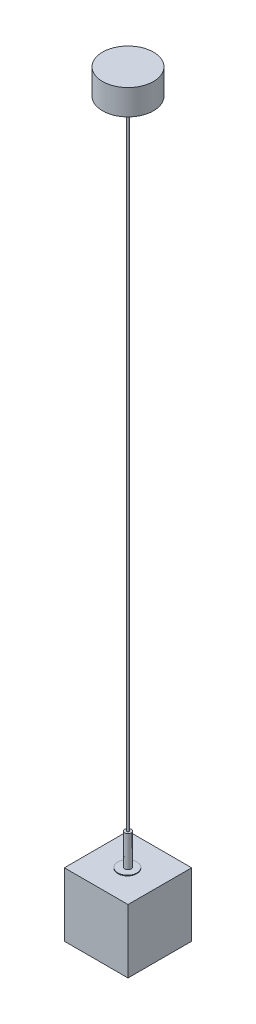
ISO-10303-21;
HEADER;
FILE_DESCRIPTION(('STEP AP214'),'2;1');
FILE_NAME('part.step','',(''),(''),'','','');
FILE_SCHEMA(('AUTOMOTIVE_DESIGN { 1 0 10303 214 1 1 1 1 }'));
ENDSEC;
DATA;
#1=APPLICATION_CONTEXT('core data for automotive mechanical design processes');
#2=APPLICATION_PROTOCOL_DEFINITION('international standard','automotive_design',2000,#1);
#3=PRODUCT_CONTEXT('',#1,'mechanical');
#4=PRODUCT('Part','Part','',(#3));
#5=PRODUCT_RELATED_PRODUCT_CATEGORY('part','',(#4));
#6=PRODUCT_DEFINITION_FORMATION('','',#4);
#7=PRODUCT_DEFINITION_CONTEXT('part definition',#1,'design');
#8=PRODUCT_DEFINITION('design','',#6,#7);
#9=PRODUCT_DEFINITION_SHAPE('','',#8);
#10=(LENGTH_UNIT() NAMED_UNIT(*) SI_UNIT(.MILLI.,.METRE.));
#11=(NAMED_UNIT(*) PLANE_ANGLE_UNIT() SI_UNIT($,.RADIAN.));
#12=(NAMED_UNIT(*) SI_UNIT($,.STERADIAN.) SOLID_ANGLE_UNIT());
#13=UNCERTAINTY_MEASURE_WITH_UNIT(LENGTH_MEASURE(1.E-05),#10,'distance_accuracy_value','');
#14=(GEOMETRIC_REPRESENTATION_CONTEXT(3) GLOBAL_UNCERTAINTY_ASSIGNED_CONTEXT((#13)) GLOBAL_UNIT_ASSIGNED_CONTEXT((#10,
#11,#12)) REPRESENTATION_CONTEXT('',''));
#15=CARTESIAN_POINT('',(0.,0.,0.));
#16=DIRECTION('',(0.,0.,1.));
#17=DIRECTION('',(1.,0.,0.));
#18=AXIS2_PLACEMENT_3D('',#15,#16,#17);
#19=CARTESIAN_POINT('',(0.,101.,1.017482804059));
#20=DIRECTION('',(0.,1.,0.));
#21=DIRECTION('',(0.,0.,1.));
#22=AXIS2_PLACEMENT_3D('',#19,#20,#21);
#23=PLANE('',#22);
#24=CARTESIAN_POINT('',(0.,101.,1.017482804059));
#25=DIRECTION('',(0.,1.,0.));
#26=DIRECTION('',(0.,0.,1.));
#27=AXIS2_PLACEMENT_3D('',#24,#25,#26);
#28=CIRCLE('',#27,15.);
#29=CARTESIAN_POINT('',(0.,101.,16.017482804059));
#30=VERTEX_POINT('',#29);
#31=EDGE_CURVE('E11',#30,#30,#28,.T.);
#32=ORIENTED_EDGE('',*,*,#31,.T.);
#33=EDGE_LOOP('',(#32));
#34=FACE_BOUND('',#33,.T.);
#35=CARTESIAN_POINT('',(0.,101.,0.));
#36=DIRECTION('',(0.,1.,0.));
#37=DIRECTION('',(0.,0.,1.));
#38=AXIS2_PLACEMENT_3D('',#35,#36,#37);
#39=CIRCLE('',#38,5.);
#40=CARTESIAN_POINT('',(0.,101.,5.));
#41=VERTEX_POINT('',#40);
#42=EDGE_CURVE('E50',#41,#41,#39,.T.);
#43=ORIENTED_EDGE('',*,*,#42,.F.);
#44=EDGE_LOOP('',(#43));
#45=FACE_BOUND('',#44,.T.);
#46=ADVANCED_FACE('F39',(#34,#45),#23,.T.);
#47=CARTESIAN_POINT('',(0.,100.,1.017482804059));
#48=DIRECTION('',(0.,1.,0.));
#49=DIRECTION('',(0.,0.,1.));
#50=AXIS2_PLACEMENT_3D('',#47,#48,#49);
#51=PLANE('',#50);
#52=CARTESIAN_POINT('',(0.,100.,1.017482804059));
#53=DIRECTION('',(0.,1.,0.));
#54=DIRECTION('',(0.,0.,1.));
#55=AXIS2_PLACEMENT_3D('',#52,#53,#54);
#56=CIRCLE('',#55,15.);
#57=CARTESIAN_POINT('',(0.,100.,16.017482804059));
#58=VERTEX_POINT('',#57);
#59=EDGE_CURVE('E43',#58,#58,#56,.T.);
#60=ORIENTED_EDGE('',*,*,#59,.F.);
#61=EDGE_LOOP('',(#60));
#62=FACE_BOUND('',#61,.T.);
#63=CARTESIAN_POINT('',(0.,100.,0.));
#64=DIRECTION('',(0.,1.,0.));
#65=DIRECTION('',(0.,0.,1.));
#66=AXIS2_PLACEMENT_3D('',#63,#64,#65);
#67=CIRCLE('',#66,5.);
#68=CARTESIAN_POINT('',(0.,100.,5.));
#69=VERTEX_POINT('',#68);
#70=EDGE_CURVE('E52',#69,#69,#67,.T.);
#71=ORIENTED_EDGE('',*,*,#70,.T.);
#72=EDGE_LOOP('',(#71));
#73=FACE_BOUND('',#72,.T.);
#74=ADVANCED_FACE('F62',(#62,#73),#51,.F.);
#75=CARTESIAN_POINT('',(0.,101.,1.017482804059));
#76=DIRECTION('',(0.,-1.,0.));
#77=DIRECTION('',(0.,0.,-1.));
#78=AXIS2_PLACEMENT_3D('',#75,#76,#77);
#79=CYLINDRICAL_SURFACE('',#78,15.);
#80=ORIENTED_EDGE('',*,*,#31,.F.);
#81=EDGE_LOOP('',(#80));
#82=FACE_BOUND('',#81,.T.);
#83=ORIENTED_EDGE('',*,*,#59,.T.);
#84=EDGE_LOOP('',(#83));
#85=FACE_BOUND('',#84,.T.);
#86=ADVANCED_FACE('F41',(#82,#85),#79,.T.);
#87=CARTESIAN_POINT('',(0.,101.,0.));
#88=DIRECTION('',(0.,-1.,0.));
#89=DIRECTION('',(0.,0.,-1.));
#90=AXIS2_PLACEMENT_3D('',#87,#88,#89);
#91=CYLINDRICAL_SURFACE('',#90,5.);
#92=ORIENTED_EDGE('',*,*,#42,.T.);
#93=EDGE_LOOP('',(#92));
#94=FACE_BOUND('',#93,.T.);
#95=ORIENTED_EDGE('',*,*,#70,.F.);
#96=EDGE_LOOP('',(#95));
#97=FACE_BOUND('',#96,.T.);
#98=ADVANCED_FACE('F58',(#94,#97),#91,.F.);
#99=CLOSED_SHELL('',(#46,#74,#86,#98));
#100=MANIFOLD_SOLID_BREP('B2',#99);
#101=CARTESIAN_POINT('',(0.,1190.,0.));
#102=DIRECTION('',(0.,-1.,0.));
#103=DIRECTION('',(0.,0.,-1.));
#104=AXIS2_PLACEMENT_3D('',#101,#102,#103);
#105=CYLINDRICAL_SURFACE('',#104,40.);
#106=CARTESIAN_POINT('',(0.,1190.,0.));
#107=DIRECTION('',(0.,1.,0.));
#108=DIRECTION('',(0.,0.,1.));
#109=AXIS2_PLACEMENT_3D('',#106,#107,#108);
#110=CIRCLE('',#109,40.);
#111=CARTESIAN_POINT('',(0.,1190.,40.));
#112=VERTEX_POINT('',#111);
#113=EDGE_CURVE('E38',#112,#112,#110,.T.);
#114=ORIENTED_EDGE('',*,*,#113,.F.);
#115=EDGE_LOOP('',(#114));
#116=FACE_BOUND('',#115,.T.);
#117=CARTESIAN_POINT('',(0.,1150.,0.));
#118=DIRECTION('',(0.,1.,0.));
#119=DIRECTION('',(0.,0.,1.));
#120=AXIS2_PLACEMENT_3D('',#117,#118,#119);
#121=CIRCLE('',#120,40.);
#122=CARTESIAN_POINT('',(0.,1150.,40.));
#123=VERTEX_POINT('',#122);
#124=EDGE_CURVE('E111',#123,#123,#121,.T.);
#125=ORIENTED_EDGE('',*,*,#124,.T.);
#126=EDGE_LOOP('',(#125));
#127=FACE_BOUND('',#126,.T.);
#128=ADVANCED_FACE('F108',(#116,#127),#105,.T.);
#129=CARTESIAN_POINT('',(0.,1190.,0.));
#130=DIRECTION('',(0.,1.,0.));
#131=DIRECTION('',(0.,0.,1.));
#132=AXIS2_PLACEMENT_3D('',#129,#130,#131);
#133=PLANE('',#132);
#134=ORIENTED_EDGE('',*,*,#113,.T.);
#135=EDGE_LOOP('',(#134));
#136=FACE_BOUND('',#135,.T.);
#137=ADVANCED_FACE('F123',(#136),#133,.T.);
#138=CARTESIAN_POINT('',(0.,1150.,0.));
#139=DIRECTION('',(0.,1.,0.));
#140=DIRECTION('',(0.,0.,1.));
#141=AXIS2_PLACEMENT_3D('',#138,#139,#140);
#142=PLANE('',#141);
#143=ORIENTED_EDGE('',*,*,#124,.F.);
#144=EDGE_LOOP('',(#143));
#145=FACE_BOUND('',#144,.T.);
#146=ADVANCED_FACE('F121',(#145),#142,.F.);
#147=CLOSED_SHELL('',(#128,#137,#146));
#148=MANIFOLD_SOLID_BREP('B6',#147);
#149=CARTESIAN_POINT('',(0.,1150.,0.));
#150=DIRECTION('',(0.,-1.,0.));
#151=DIRECTION('',(0.,0.,-1.));
#152=AXIS2_PLACEMENT_3D('',#149,#150,#151);
#153=CYLINDRICAL_SURFACE('',#152,1.5);
#154=CARTESIAN_POINT('',(0.,1150.,0.));
#155=DIRECTION('',(0.,1.,0.));
#156=DIRECTION('',(0.,0.,1.));
#157=AXIS2_PLACEMENT_3D('',#154,#155,#156);
#158=CIRCLE('',#157,1.5);
#159=CARTESIAN_POINT('',(0.,1150.,1.5));
#160=VERTEX_POINT('',#159);
#161=EDGE_CURVE('E107',#160,#160,#158,.T.);
#162=ORIENTED_EDGE('',*,*,#161,.F.);
#163=EDGE_LOOP('',(#162));
#164=FACE_BOUND('',#163,.T.);
#165=CARTESIAN_POINT('',(0.,150.,0.));
#166=DIRECTION('',(0.,1.,0.));
#167=DIRECTION('',(0.,0.,1.));
#168=AXIS2_PLACEMENT_3D('',#165,#166,#167);
#169=CIRCLE('',#168,1.5);
#170=CARTESIAN_POINT('',(0.,150.,1.5));
#171=VERTEX_POINT('',#170);
#172=EDGE_CURVE('E159',#171,#171,#169,.T.);
#173=ORIENTED_EDGE('',*,*,#172,.T.);
#174=EDGE_LOOP('',(#173));
#175=FACE_BOUND('',#174,.T.);
#176=ADVANCED_FACE('F156',(#164,#175),#153,.T.);
#177=CARTESIAN_POINT('',(0.,1150.,0.));
#178=DIRECTION('',(0.,1.,0.));
#179=DIRECTION('',(0.,0.,1.));
#180=AXIS2_PLACEMENT_3D('',#177,#178,#179);
#181=PLANE('',#180);
#182=ORIENTED_EDGE('',*,*,#161,.T.);
#183=EDGE_LOOP('',(#182));
#184=FACE_BOUND('',#183,.T.);
#185=ADVANCED_FACE('F171',(#184),#181,.T.);
#186=CARTESIAN_POINT('',(0.,150.,0.));
#187=DIRECTION('',(0.,1.,0.));
#188=DIRECTION('',(0.,0.,1.));
#189=AXIS2_PLACEMENT_3D('',#186,#187,#188);
#190=PLANE('',#189);
#191=ORIENTED_EDGE('',*,*,#172,.F.);
#192=EDGE_LOOP('',(#191));
#193=FACE_BOUND('',#192,.T.);
#194=ADVANCED_FACE('F169',(#193),#190,.F.);
#195=CLOSED_SHELL('',(#176,#185,#194));
#196=MANIFOLD_SOLID_BREP('B33',#195);
#197=CARTESIAN_POINT('',(0.,150.,0.));
#198=DIRECTION('',(0.,-1.,0.));
#199=DIRECTION('',(0.,0.,-1.));
#200=AXIS2_PLACEMENT_3D('',#197,#198,#199);
#201=CYLINDRICAL_SURFACE('',#200,5.);
#202=CARTESIAN_POINT('',(0.,150.,0.));
#203=DIRECTION('',(0.,1.,0.));
#204=DIRECTION('',(0.,0.,1.));
#205=AXIS2_PLACEMENT_3D('',#202,#203,#204);
#206=CIRCLE('',#205,5.);
#207=CARTESIAN_POINT('',(0.,150.,5.));
#208=VERTEX_POINT('',#207);
#209=EDGE_CURVE('E155',#208,#208,#206,.T.);
#210=ORIENTED_EDGE('',*,*,#209,.F.);
#211=EDGE_LOOP('',(#210));
#212=FACE_BOUND('',#211,.T.);
#213=CARTESIAN_POINT('',(0.,100.,0.));
#214=DIRECTION('',(0.,1.,0.));
#215=DIRECTION('',(0.,0.,1.));
#216=AXIS2_PLACEMENT_3D('',#213,#214,#215);
#217=CIRCLE('',#216,5.);
#218=CARTESIAN_POINT('',(0.,100.,5.));
#219=VERTEX_POINT('',#218);
#220=EDGE_CURVE('E208',#219,#219,#217,.T.);
#221=ORIENTED_EDGE('',*,*,#220,.T.);
#222=EDGE_LOOP('',(#221));
#223=FACE_BOUND('',#222,.T.);
#224=ADVANCED_FACE('F205',(#212,#223),#201,.T.);
#225=CARTESIAN_POINT('',(0.,150.,0.));
#226=DIRECTION('',(0.,1.,0.));
#227=DIRECTION('',(0.,0.,1.));
#228=AXIS2_PLACEMENT_3D('',#225,#226,#227);
#229=PLANE('',#228);
#230=ORIENTED_EDGE('',*,*,#209,.T.);
#231=EDGE_LOOP('',(#230));
#232=FACE_BOUND('',#231,.T.);
#233=ADVANCED_FACE('F220',(#232),#229,.T.);
#234=CARTESIAN_POINT('',(0.,100.,0.));
#235=DIRECTION('',(0.,1.,0.));
#236=DIRECTION('',(0.,0.,1.));
#237=AXIS2_PLACEMENT_3D('',#234,#235,#236);
#238=PLANE('',#237);
#239=ORIENTED_EDGE('',*,*,#220,.F.);
#240=EDGE_LOOP('',(#239));
#241=FACE_BOUND('',#240,.T.);
#242=ADVANCED_FACE('F218',(#241),#238,.F.);
#243=CLOSED_SHELL('',(#224,#233,#242));
#244=MANIFOLD_SOLID_BREP('B102',#243);
#245=CARTESIAN_POINT('',(50.,100.,-50.));
#246=DIRECTION('',(-1.,0.,0.));
#247=DIRECTION('',(0.,0.,1.));
#248=AXIS2_PLACEMENT_3D('',#245,#246,#247);
#249=PLANE('',#248);
#250=DIRECTION('',(0.,0.,-1.));
#251=VECTOR('',#250,1.);
#252=CARTESIAN_POINT('',(50.,0.,-50.));
#253=LINE('',#252,#251);
#254=CARTESIAN_POINT('',(50.,0.,50.));
#255=VERTEX_POINT('',#254);
#256=CARTESIAN_POINT('',(50.,0.,-50.));
#257=VERTEX_POINT('',#256);
#258=EDGE_CURVE('E341',#255,#257,#253,.T.);
#259=ORIENTED_EDGE('',*,*,#258,.T.);
#260=DIRECTION('',(0.,-1.,0.));
#261=VECTOR('',#260,1.);
#262=CARTESIAN_POINT('',(50.,100.,-50.));
#263=LINE('',#262,#261);
#264=CARTESIAN_POINT('',(50.,100.,-50.));
#265=VERTEX_POINT('',#264);
#266=EDGE_CURVE('E203',#265,#257,#263,.T.);
#267=ORIENTED_EDGE('',*,*,#266,.F.);
#268=DIRECTION('',(0.,0.,-1.));
#269=VECTOR('',#268,1.);
#270=CARTESIAN_POINT('',(50.,100.,-50.));
#271=LINE('',#270,#269);
#272=CARTESIAN_POINT('',(50.,100.,50.));
#273=VERTEX_POINT('',#272);
#274=EDGE_CURVE('E361',#273,#265,#271,.T.);
#275=ORIENTED_EDGE('',*,*,#274,.F.);
#276=DIRECTION('',(0.,-1.,0.));
#277=VECTOR('',#276,1.);
#278=CARTESIAN_POINT('',(50.,100.,50.));
#279=LINE('',#278,#277);
#280=EDGE_CURVE('E366',#273,#255,#279,.T.);
#281=ORIENTED_EDGE('',*,*,#280,.T.);
#282=EDGE_LOOP('',(#259,#267,#275,#281));
#283=FACE_BOUND('',#282,.T.);
#284=ADVANCED_FACE('F245',(#283),#249,.F.);
#285=CARTESIAN_POINT('',(-50.,100.,-50.));
#286=DIRECTION('',(0.,0.,1.));
#287=DIRECTION('',(1.,0.,0.));
#288=AXIS2_PLACEMENT_3D('',#285,#286,#287);
#289=PLANE('',#288);
#290=DIRECTION('',(-1.,0.,0.));
#291=VECTOR('',#290,1.);
#292=CARTESIAN_POINT('',(-50.,0.,-50.));
#293=LINE('',#292,#291);
#294=CARTESIAN_POINT('',(-50.,0.,-50.));
#295=VERTEX_POINT('',#294);
#296=EDGE_CURVE('E345',#257,#295,#293,.T.);
#297=ORIENTED_EDGE('',*,*,#296,.T.);
#298=DIRECTION('',(0.,-1.,0.));
#299=VECTOR('',#298,1.);
#300=CARTESIAN_POINT('',(-50.,100.,-50.));
#301=LINE('',#300,#299);
#302=CARTESIAN_POINT('',(-50.,100.,-50.));
#303=VERTEX_POINT('',#302);
#304=EDGE_CURVE('E252',#303,#295,#301,.T.);
#305=ORIENTED_EDGE('',*,*,#304,.F.);
#306=DIRECTION('',(-1.,0.,0.));
#307=VECTOR('',#306,1.);
#308=CARTESIAN_POINT('',(-50.,100.,-50.));
#309=LINE('',#308,#307);
#310=EDGE_CURVE('E296',#265,#303,#309,.T.);
#311=ORIENTED_EDGE('',*,*,#310,.F.);
#312=ORIENTED_EDGE('',*,*,#266,.T.);
#313=EDGE_LOOP('',(#297,#305,#311,#312));
#314=FACE_BOUND('',#313,.T.);
#315=ADVANCED_FACE('F395',(#314),#289,.F.);
#316=CARTESIAN_POINT('',(-50.,100.,-50.));
#317=DIRECTION('',(1.,0.,0.));
#318=DIRECTION('',(0.,0.,-1.));
#319=AXIS2_PLACEMENT_3D('',#316,#317,#318);
#320=PLANE('',#319);
#321=DIRECTION('',(0.,0.,1.));
#322=VECTOR('',#321,1.);
#323=CARTESIAN_POINT('',(-50.,0.,-50.));
#324=LINE('',#323,#322);
#325=CARTESIAN_POINT('',(-50.,0.,50.));
#326=VERTEX_POINT('',#325);
#327=EDGE_CURVE('E369',#295,#326,#324,.T.);
#328=ORIENTED_EDGE('',*,*,#327,.T.);
#329=DIRECTION('',(0.,-1.,0.));
#330=VECTOR('',#329,1.);
#331=CARTESIAN_POINT('',(-50.,100.,50.));
#332=LINE('',#331,#330);
#333=CARTESIAN_POINT('',(-50.,100.,50.));
#334=VERTEX_POINT('',#333);
#335=EDGE_CURVE('E373',#334,#326,#332,.T.);
#336=ORIENTED_EDGE('',*,*,#335,.F.);
#337=DIRECTION('',(0.,0.,1.));
#338=VECTOR('',#337,1.);
#339=CARTESIAN_POINT('',(-50.,100.,-50.));
#340=LINE('',#339,#338);
#341=EDGE_CURVE('E364',#303,#334,#340,.T.);
#342=ORIENTED_EDGE('',*,*,#341,.F.);
#343=ORIENTED_EDGE('',*,*,#304,.T.);
#344=EDGE_LOOP('',(#328,#336,#342,#343));
#345=FACE_BOUND('',#344,.T.);
#346=ADVANCED_FACE('F378',(#345),#320,.F.);
#347=CARTESIAN_POINT('',(-50.,100.,50.));
#348=DIRECTION('',(0.,0.,-1.));
#349=DIRECTION('',(-1.,0.,0.));
#350=AXIS2_PLACEMENT_3D('',#347,#348,#349);
#351=PLANE('',#350);
#352=DIRECTION('',(1.,0.,0.));
#353=VECTOR('',#352,1.);
#354=CARTESIAN_POINT('',(-50.,0.,50.));
#355=LINE('',#354,#353);
#356=EDGE_CURVE('E289',#326,#255,#355,.T.);
#357=ORIENTED_EDGE('',*,*,#356,.T.);
#358=ORIENTED_EDGE('',*,*,#280,.F.);
#359=DIRECTION('',(1.,0.,0.));
#360=VECTOR('',#359,1.);
#361=CARTESIAN_POINT('',(-50.,100.,50.));
#362=LINE('',#361,#360);
#363=EDGE_CURVE('E268',#334,#273,#362,.T.);
#364=ORIENTED_EDGE('',*,*,#363,.F.);
#365=ORIENTED_EDGE('',*,*,#335,.T.);
#366=EDGE_LOOP('',(#357,#358,#364,#365));
#367=FACE_BOUND('',#366,.T.);
#368=ADVANCED_FACE('F386',(#367),#351,.F.);
#369=CARTESIAN_POINT('',(0.,100.,0.));
#370=DIRECTION('',(0.,1.,0.));
#371=DIRECTION('',(0.,0.,1.));
#372=AXIS2_PLACEMENT_3D('',#369,#370,#371);
#373=PLANE('',#372);
#374=ORIENTED_EDGE('',*,*,#274,.T.);
#375=ORIENTED_EDGE('',*,*,#310,.T.);
#376=ORIENTED_EDGE('',*,*,#341,.T.);
#377=ORIENTED_EDGE('',*,*,#363,.T.);
#378=EDGE_LOOP('',(#374,#375,#376,#377));
#379=FACE_BOUND('',#378,.T.);
#380=ADVANCED_FACE('F388',(#379),#373,.T.);
#381=CARTESIAN_POINT('',(0.,0.,0.));
#382=DIRECTION('',(0.,1.,0.));
#383=DIRECTION('',(0.,0.,1.));
#384=AXIS2_PLACEMENT_3D('',#381,#382,#383);
#385=PLANE('',#384);
#386=DIRECTION('',(1.,0.,0.));
#387=VECTOR('',#386,1.);
#388=CARTESIAN_POINT('',(-50.,0.,48.));
#389=LINE('',#388,#387);
#390=CARTESIAN_POINT('',(-48.,0.,48.));
#391=VERTEX_POINT('',#390);
#392=CARTESIAN_POINT('',(48.,0.,48.));
#393=VERTEX_POINT('',#392);
#394=EDGE_CURVE('E336',#391,#393,#389,.T.);
#395=ORIENTED_EDGE('',*,*,#394,.T.);
#396=DIRECTION('',(0.,0.,-1.));
#397=VECTOR('',#396,1.);
#398=CARTESIAN_POINT('',(48.,0.,-50.));
#399=LINE('',#398,#397);
#400=CARTESIAN_POINT('',(48.,0.,-48.));
#401=VERTEX_POINT('',#400);
#402=EDGE_CURVE('E355',#393,#401,#399,.T.);
#403=ORIENTED_EDGE('',*,*,#402,.T.);
#404=DIRECTION('',(-1.,0.,0.));
#405=VECTOR('',#404,1.);
#406=CARTESIAN_POINT('',(-50.,0.,-48.));
#407=LINE('',#406,#405);
#408=CARTESIAN_POINT('',(-48.,0.,-48.));
#409=VERTEX_POINT('',#408);
#410=EDGE_CURVE('E340',#401,#409,#407,.T.);
#411=ORIENTED_EDGE('',*,*,#410,.T.);
#412=DIRECTION('',(0.,0.,1.));
#413=VECTOR('',#412,1.);
#414=CARTESIAN_POINT('',(-48.,0.,-50.));
#415=LINE('',#414,#413);
#416=EDGE_CURVE('E259',#409,#391,#415,.T.);
#417=ORIENTED_EDGE('',*,*,#416,.T.);
#418=EDGE_LOOP('',(#395,#403,#411,#417));
#419=FACE_BOUND('',#418,.T.);
#420=ORIENTED_EDGE('',*,*,#258,.F.);
#421=ORIENTED_EDGE('',*,*,#356,.F.);
#422=ORIENTED_EDGE('',*,*,#327,.F.);
#423=ORIENTED_EDGE('',*,*,#296,.F.);
#424=EDGE_LOOP('',(#420,#421,#422,#423));
#425=FACE_BOUND('',#424,.T.);
#426=ADVANCED_FACE('F382',(#419,#425),#385,.F.);
#427=CARTESIAN_POINT('',(48.,100.,-50.));
#428=DIRECTION('',(-1.,0.,0.));
#429=DIRECTION('',(0.,0.,1.));
#430=AXIS2_PLACEMENT_3D('',#427,#428,#429);
#431=PLANE('',#430);
#432=ORIENTED_EDGE('',*,*,#402,.F.);
#433=DIRECTION('',(0.,-1.,0.));
#434=VECTOR('',#433,1.);
#435=CARTESIAN_POINT('',(48.,100.,48.));
#436=LINE('',#435,#434);
#437=CARTESIAN_POINT('',(48.,98.,48.));
#438=VERTEX_POINT('',#437);
#439=EDGE_CURVE('E335',#438,#393,#436,.T.);
#440=ORIENTED_EDGE('',*,*,#439,.F.);
#441=DIRECTION('',(0.,0.,-1.));
#442=VECTOR('',#441,1.);
#443=CARTESIAN_POINT('',(48.,98.,-50.));
#444=LINE('',#443,#442);
#445=CARTESIAN_POINT('',(48.,98.,-48.));
#446=VERTEX_POINT('',#445);
#447=EDGE_CURVE('E323',#438,#446,#444,.T.);
#448=ORIENTED_EDGE('',*,*,#447,.T.);
#449=DIRECTION('',(0.,-1.,0.));
#450=VECTOR('',#449,1.);
#451=CARTESIAN_POINT('',(48.,100.,-48.));
#452=LINE('',#451,#450);
#453=EDGE_CURVE('E333',#446,#401,#452,.T.);
#454=ORIENTED_EDGE('',*,*,#453,.T.);
#455=EDGE_LOOP('',(#432,#440,#448,#454));
#456=FACE_BOUND('',#455,.T.);
#457=ADVANCED_FACE('F332',(#456),#431,.T.);
#458=CARTESIAN_POINT('',(-50.,100.,-48.));
#459=DIRECTION('',(0.,0.,1.));
#460=DIRECTION('',(1.,0.,0.));
#461=AXIS2_PLACEMENT_3D('',#458,#459,#460);
#462=PLANE('',#461);
#463=ORIENTED_EDGE('',*,*,#410,.F.);
#464=ORIENTED_EDGE('',*,*,#453,.F.);
#465=DIRECTION('',(-1.,0.,0.));
#466=VECTOR('',#465,1.);
#467=CARTESIAN_POINT('',(-50.,98.,-48.));
#468=LINE('',#467,#466);
#469=CARTESIAN_POINT('',(-48.,98.,-48.));
#470=VERTEX_POINT('',#469);
#471=EDGE_CURVE('E319',#446,#470,#468,.T.);
#472=ORIENTED_EDGE('',*,*,#471,.T.);
#473=DIRECTION('',(0.,-1.,0.));
#474=VECTOR('',#473,1.);
#475=CARTESIAN_POINT('',(-48.,100.,-48.));
#476=LINE('',#475,#474);
#477=EDGE_CURVE('E342',#470,#409,#476,.T.);
#478=ORIENTED_EDGE('',*,*,#477,.T.);
#479=EDGE_LOOP('',(#463,#464,#472,#478));
#480=FACE_BOUND('',#479,.T.);
#481=ADVANCED_FACE('F338',(#480),#462,.T.);
#482=CARTESIAN_POINT('',(-48.,100.,-50.));
#483=DIRECTION('',(1.,0.,0.));
#484=DIRECTION('',(0.,0.,-1.));
#485=AXIS2_PLACEMENT_3D('',#482,#483,#484);
#486=PLANE('',#485);
#487=ORIENTED_EDGE('',*,*,#416,.F.);
#488=ORIENTED_EDGE('',*,*,#477,.F.);
#489=DIRECTION('',(0.,0.,1.));
#490=VECTOR('',#489,1.);
#491=CARTESIAN_POINT('',(-48.,98.,-50.));
#492=LINE('',#491,#490);
#493=CARTESIAN_POINT('',(-48.,98.,48.));
#494=VERTEX_POINT('',#493);
#495=EDGE_CURVE('E324',#470,#494,#492,.T.);
#496=ORIENTED_EDGE('',*,*,#495,.T.);
#497=DIRECTION('',(0.,-1.,0.));
#498=VECTOR('',#497,1.);
#499=CARTESIAN_POINT('',(-48.,100.,48.));
#500=LINE('',#499,#498);
#501=EDGE_CURVE('E347',#494,#391,#500,.T.);
#502=ORIENTED_EDGE('',*,*,#501,.T.);
#503=EDGE_LOOP('',(#487,#488,#496,#502));
#504=FACE_BOUND('',#503,.T.);
#505=ADVANCED_FACE('F443',(#504),#486,.T.);
#506=CARTESIAN_POINT('',(-50.,100.,48.));
#507=DIRECTION('',(0.,0.,-1.));
#508=DIRECTION('',(-1.,0.,0.));
#509=AXIS2_PLACEMENT_3D('',#506,#507,#508);
#510=PLANE('',#509);
#511=ORIENTED_EDGE('',*,*,#394,.F.);
#512=ORIENTED_EDGE('',*,*,#501,.F.);
#513=DIRECTION('',(1.,0.,0.));
#514=VECTOR('',#513,1.);
#515=CARTESIAN_POINT('',(-50.,98.,48.));
#516=LINE('',#515,#514);
#517=EDGE_CURVE('E350',#494,#438,#516,.T.);
#518=ORIENTED_EDGE('',*,*,#517,.T.);
#519=ORIENTED_EDGE('',*,*,#439,.T.);
#520=EDGE_LOOP('',(#511,#512,#518,#519));
#521=FACE_BOUND('',#520,.T.);
#522=ADVANCED_FACE('F452',(#521),#510,.T.);
#523=CARTESIAN_POINT('',(0.,98.,0.));
#524=DIRECTION('',(0.,1.,0.));
#525=DIRECTION('',(0.,0.,1.));
#526=AXIS2_PLACEMENT_3D('',#523,#524,#525);
#527=PLANE('',#526);
#528=ORIENTED_EDGE('',*,*,#447,.F.);
#529=ORIENTED_EDGE('',*,*,#517,.F.);
#530=ORIENTED_EDGE('',*,*,#495,.F.);
#531=ORIENTED_EDGE('',*,*,#471,.F.);
#532=EDGE_LOOP('',(#528,#529,#530,#531));
#533=FACE_BOUND('',#532,.T.);
#534=ADVANCED_FACE('F321',(#533),#527,.F.);
#535=CLOSED_SHELL('',(#284,#315,#346,#368,#380,#426,#457,#481,#505,#522,#534));
#536=MANIFOLD_SOLID_BREP('B150',#535);
#537=ADVANCED_BREP_SHAPE_REPRESENTATION('',(#18,#100,#148,#196,#244,#536),#14);
#538=SHAPE_DEFINITION_REPRESENTATION(#9,#537);
ENDSEC;
END-ISO-10303-21;
